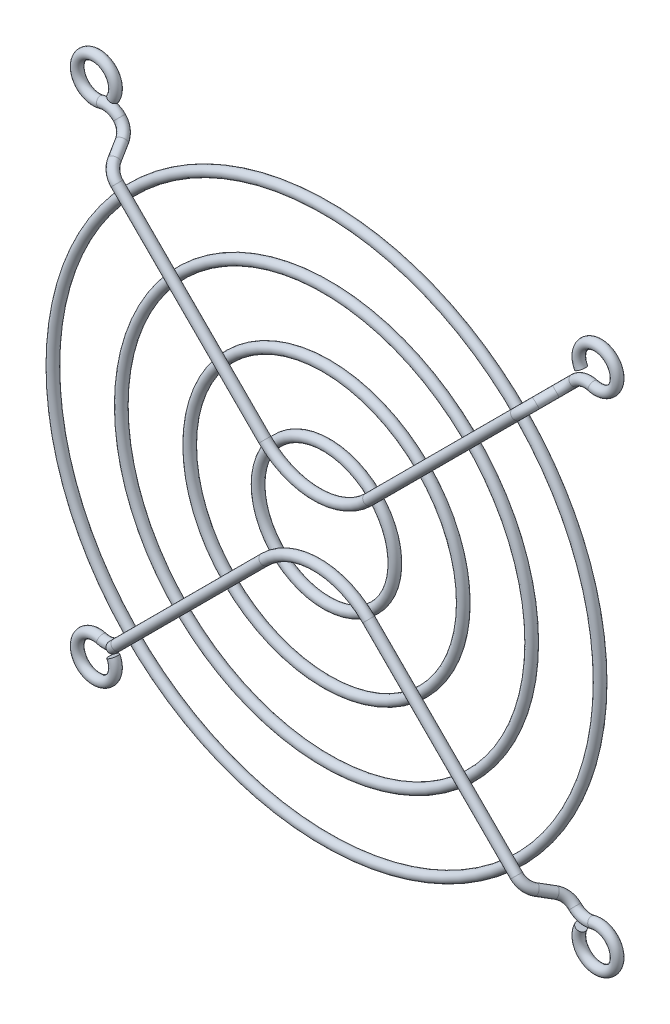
from build123d import *

# Parameters (mm, degrees)
SKETCH6_R = 0.8
SKETCH7_R = 0.8


with BuildPart() as part:
    # Sweep1: sweep along a curve in space
    with BuildLine() as sweep1_path:
        ThreePointArc((-38.4791267, 39.751747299, 0), (-43.219575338, 43.708306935, 0), (-40.392127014, 38.21906715, 0))
        ThreePointArc((-40.392127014, 38.21906715, 0), (-38.818988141, 38.235615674, 0), (-37.45378478, 37.45378478, 0))
        ThreePointArc((-37.45378478, 37.45378478, 0), (-36.439593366, 36.439593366, 0.365074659), (-35.672239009, 35.672239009, 1.37144563))
        Line((-35.672239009, 35.672239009, 1.37144563), (-34.640599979, 34.640599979, 3.62855437))
        ThreePointArc((-34.640599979, 34.640599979, 3.62855437), (-33.873245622, 33.873245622, 4.634925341), (-32.859054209, 32.859054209, 5))
        Line((-32.859054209, 32.859054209, 5), (-8.535533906, 8.535533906, 5))
        ThreePointArc((-8.535533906, 8.535533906, 5), (-4.619397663, 5.918855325, 5), (0, 5, 5))
    # Sketch6 → Sweep1 (sweep)
    with BuildSketch(Plane(origin=(0, 0, 0), x_dir=(0, 0, -1), z_dir=(1, 0, 0))):
        with Locations((-5, 5)):
            Circle(SKETCH6_R)
    sweep1 = sweep(path=sweep1_path.line)

    # Mirror1: Sweep1 across plane
    add(sweep1.mirror(Plane(origin=(0, 5, 5), x_dir=(0, 0, 1), z_dir=(1, 0, 0))))


with BuildPart() as body_2:
    # Mirror3: mirrored copy
    add(part.part.mirror(Plane.ZX))


with BuildPart() as body_3:
    # Sketch7 → Revolve1 (revolve)
    with BuildSketch(Plane(origin=(0, 0, 0), x_dir=(0, 0, -1), z_dir=(1, 0, 0)), mode=Mode.PRIVATE) as revolve1_sk:
        with Locations((-3.4, 45)):
            Circle(SKETCH7_R)
        with Locations((-3.4, 22.5)):
            Circle(SKETCH7_R)
        with Locations((-3.4, 33.75)):
            Circle(SKETCH7_R)
        with Locations((-3.4, 11.25)):
            Circle(SKETCH7_R)
    revolve(revolve1_sk.sketch.rotate(Axis((0, 0, 0), (0, 0, 1)), 90), axis=Axis((0, 0, 0), (0, 0, 1)))


solid = Compound([part.part, body_2.part, body_3.part])
